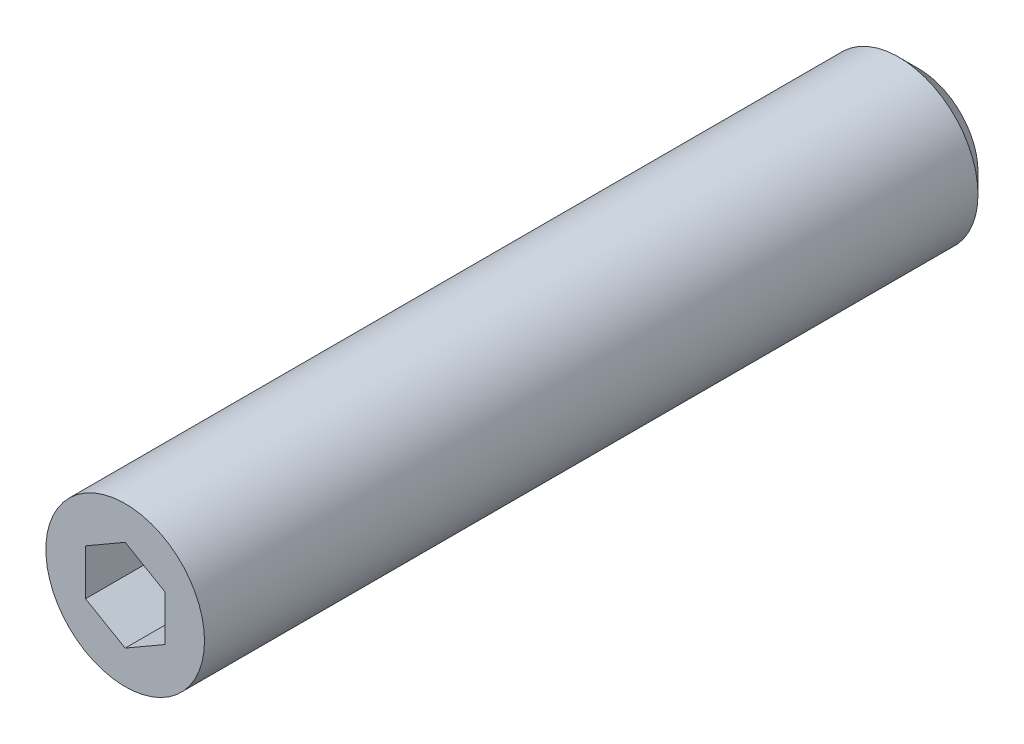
ISO-10303-21;
HEADER;
FILE_DESCRIPTION(('STEP AP214'),'2;1');
FILE_NAME('part.step','',(''),(''),'','','');
FILE_SCHEMA(('AUTOMOTIVE_DESIGN { 1 0 10303 214 1 1 1 1 }'));
ENDSEC;
DATA;
#1=APPLICATION_CONTEXT('core data for automotive mechanical design processes');
#2=APPLICATION_PROTOCOL_DEFINITION('international standard','automotive_design',2000,#1);
#3=PRODUCT_CONTEXT('',#1,'mechanical');
#4=PRODUCT('Part','Part','',(#3));
#5=PRODUCT_RELATED_PRODUCT_CATEGORY('part','',(#4));
#6=PRODUCT_DEFINITION_FORMATION('','',#4);
#7=PRODUCT_DEFINITION_CONTEXT('part definition',#1,'design');
#8=PRODUCT_DEFINITION('design','',#6,#7);
#9=PRODUCT_DEFINITION_SHAPE('','',#8);
#10=(LENGTH_UNIT() NAMED_UNIT(*) SI_UNIT(.MILLI.,.METRE.));
#11=(NAMED_UNIT(*) PLANE_ANGLE_UNIT() SI_UNIT($,.RADIAN.));
#12=(NAMED_UNIT(*) SI_UNIT($,.STERADIAN.) SOLID_ANGLE_UNIT());
#13=UNCERTAINTY_MEASURE_WITH_UNIT(LENGTH_MEASURE(1.E-05),#10,'distance_accuracy_value','');
#14=(GEOMETRIC_REPRESENTATION_CONTEXT(3) GLOBAL_UNCERTAINTY_ASSIGNED_CONTEXT((#13)) GLOBAL_UNIT_ASSIGNED_CONTEXT((#10,
#11,#12)) REPRESENTATION_CONTEXT('',''));
#15=CARTESIAN_POINT('',(0.,0.,0.));
#16=DIRECTION('',(0.,0.,1.));
#17=DIRECTION('',(1.,0.,0.));
#18=AXIS2_PLACEMENT_3D('',#15,#16,#17);
#19=CARTESIAN_POINT('',(0.,4.61880215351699,74.));
#20=DIRECTION('',(-0.5,-0.866025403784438,0.));
#21=DIRECTION('',(0.866025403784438,-0.5,0.));
#22=AXIS2_PLACEMENT_3D('',#19,#20,#21);
#23=PLANE('',#22);
#24=DIRECTION('',(0.,0.,1.));
#25=VECTOR('',#24,1.);
#26=CARTESIAN_POINT('',(4.,2.30940107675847,74.));
#27=LINE('',#26,#25);
#28=CARTESIAN_POINT('',(4.,2.30940107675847,74.));
#29=VERTEX_POINT('',#28);
#30=CARTESIAN_POINT('',(4.,2.30940107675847,80.));
#31=VERTEX_POINT('',#30);
#32=EDGE_CURVE('E63',#29,#31,#27,.T.);
#33=ORIENTED_EDGE('',*,*,#32,.T.);
#34=DIRECTION('',(0.866025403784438,-0.5,0.));
#35=VECTOR('',#34,1.);
#36=CARTESIAN_POINT('',(0.,4.61880215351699,80.));
#37=LINE('',#36,#35);
#38=CARTESIAN_POINT('',(0.,4.61880215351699,80.));
#39=VERTEX_POINT('',#38);
#40=EDGE_CURVE('E29',#39,#31,#37,.T.);
#41=ORIENTED_EDGE('',*,*,#40,.F.);
#42=DIRECTION('',(0.,0.,1.));
#43=VECTOR('',#42,1.);
#44=CARTESIAN_POINT('',(0.,4.61880215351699,74.));
#45=LINE('',#44,#43);
#46=CARTESIAN_POINT('',(0.,4.61880215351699,74.));
#47=VERTEX_POINT('',#46);
#48=EDGE_CURVE('E33',#47,#39,#45,.T.);
#49=ORIENTED_EDGE('',*,*,#48,.F.);
#50=DIRECTION('',(0.866025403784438,-0.5,0.));
#51=VECTOR('',#50,1.);
#52=CARTESIAN_POINT('',(0.,4.61880215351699,74.));
#53=LINE('',#52,#51);
#54=EDGE_CURVE('E65',#47,#29,#53,.T.);
#55=ORIENTED_EDGE('',*,*,#54,.T.);
#56=EDGE_LOOP('',(#33,#41,#49,#55));
#57=FACE_BOUND('',#56,.T.);
#58=ADVANCED_FACE('F14',(#57),#23,.T.);
#59=CARTESIAN_POINT('',(4.,2.30940107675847,74.));
#60=DIRECTION('',(-1.,0.,0.));
#61=DIRECTION('',(0.,-1.,0.));
#62=AXIS2_PLACEMENT_3D('',#59,#60,#61);
#63=PLANE('',#62);
#64=DIRECTION('',(0.,0.,1.));
#65=VECTOR('',#64,1.);
#66=CARTESIAN_POINT('',(4.,-2.3094010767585,74.));
#67=LINE('',#66,#65);
#68=CARTESIAN_POINT('',(4.,-2.3094010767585,74.));
#69=VERTEX_POINT('',#68);
#70=CARTESIAN_POINT('',(4.,-2.3094010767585,80.));
#71=VERTEX_POINT('',#70);
#72=EDGE_CURVE('E70',#69,#71,#67,.T.);
#73=ORIENTED_EDGE('',*,*,#72,.T.);
#74=DIRECTION('',(0.,-1.,0.));
#75=VECTOR('',#74,1.);
#76=CARTESIAN_POINT('',(4.,2.30940107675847,80.));
#77=LINE('',#76,#75);
#78=EDGE_CURVE('E73',#31,#71,#77,.T.);
#79=ORIENTED_EDGE('',*,*,#78,.F.);
#80=ORIENTED_EDGE('',*,*,#32,.F.);
#81=DIRECTION('',(0.,-1.,0.));
#82=VECTOR('',#81,1.);
#83=CARTESIAN_POINT('',(4.,2.30940107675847,74.));
#84=LINE('',#83,#82);
#85=EDGE_CURVE('E100',#29,#69,#84,.T.);
#86=ORIENTED_EDGE('',*,*,#85,.T.);
#87=EDGE_LOOP('',(#73,#79,#80,#86));
#88=FACE_BOUND('',#87,.T.);
#89=ADVANCED_FACE('F74',(#88),#63,.T.);
#90=CARTESIAN_POINT('',(0.,-4.61880215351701,74.));
#91=DIRECTION('',(0.5,-0.866025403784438,0.));
#92=DIRECTION('',(0.866025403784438,0.5,0.));
#93=AXIS2_PLACEMENT_3D('',#90,#91,#92);
#94=PLANE('',#93);
#95=DIRECTION('',(0.,0.,1.));
#96=VECTOR('',#95,1.);
#97=CARTESIAN_POINT('',(0.,-4.61880215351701,74.));
#98=LINE('',#97,#96);
#99=CARTESIAN_POINT('',(0.,-4.61880215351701,74.));
#100=VERTEX_POINT('',#99);
#101=CARTESIAN_POINT('',(0.,-4.61880215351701,80.));
#102=VERTEX_POINT('',#101);
#103=EDGE_CURVE('E108',#100,#102,#98,.T.);
#104=ORIENTED_EDGE('',*,*,#103,.T.);
#105=DIRECTION('',(0.866025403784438,0.5,0.));
#106=VECTOR('',#105,1.);
#107=CARTESIAN_POINT('',(0.,-4.61880215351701,80.));
#108=LINE('',#107,#106);
#109=EDGE_CURVE('E78',#102,#71,#108,.T.);
#110=ORIENTED_EDGE('',*,*,#109,.T.);
#111=ORIENTED_EDGE('',*,*,#72,.F.);
#112=DIRECTION('',(0.866025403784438,0.5,0.));
#113=VECTOR('',#112,1.);
#114=CARTESIAN_POINT('',(0.,-4.61880215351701,74.));
#115=LINE('',#114,#113);
#116=EDGE_CURVE('E97',#100,#69,#115,.T.);
#117=ORIENTED_EDGE('',*,*,#116,.F.);
#118=EDGE_LOOP('',(#104,#110,#111,#117));
#119=FACE_BOUND('',#118,.T.);
#120=ADVANCED_FACE('F135',(#119),#94,.F.);
#121=CARTESIAN_POINT('',(0.,-4.61880215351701,74.));
#122=DIRECTION('',(0.5,0.866025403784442,0.));
#123=DIRECTION('',(-0.866025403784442,0.5,0.));
#124=AXIS2_PLACEMENT_3D('',#121,#122,#123);
#125=PLANE('',#124);
#126=DIRECTION('',(0.,0.,1.));
#127=VECTOR('',#126,1.);
#128=CARTESIAN_POINT('',(-4.,-2.30940107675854,74.));
#129=LINE('',#128,#127);
#130=CARTESIAN_POINT('',(-4.,-2.30940107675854,74.));
#131=VERTEX_POINT('',#130);
#132=CARTESIAN_POINT('',(-4.,-2.30940107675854,80.));
#133=VERTEX_POINT('',#132);
#134=EDGE_CURVE('E106',#131,#133,#129,.T.);
#135=ORIENTED_EDGE('',*,*,#134,.T.);
#136=DIRECTION('',(-0.866025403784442,0.5,0.));
#137=VECTOR('',#136,1.);
#138=CARTESIAN_POINT('',(0.,-4.61880215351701,80.));
#139=LINE('',#138,#137);
#140=EDGE_CURVE('E173',#102,#133,#139,.T.);
#141=ORIENTED_EDGE('',*,*,#140,.F.);
#142=ORIENTED_EDGE('',*,*,#103,.F.);
#143=DIRECTION('',(-0.866025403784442,0.5,0.));
#144=VECTOR('',#143,1.);
#145=CARTESIAN_POINT('',(0.,-4.61880215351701,74.));
#146=LINE('',#145,#144);
#147=EDGE_CURVE('E94',#100,#131,#146,.T.);
#148=ORIENTED_EDGE('',*,*,#147,.T.);
#149=EDGE_LOOP('',(#135,#141,#142,#148));
#150=FACE_BOUND('',#149,.T.);
#151=ADVANCED_FACE('F147',(#150),#125,.T.);
#152=CARTESIAN_POINT('',(-4.,2.30940107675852,74.));
#153=DIRECTION('',(-1.,0.,0.));
#154=DIRECTION('',(0.,-1.,0.));
#155=AXIS2_PLACEMENT_3D('',#152,#153,#154);
#156=PLANE('',#155);
#157=DIRECTION('',(0.,0.,1.));
#158=VECTOR('',#157,1.);
#159=CARTESIAN_POINT('',(-4.,2.30940107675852,74.));
#160=LINE('',#159,#158);
#161=CARTESIAN_POINT('',(-4.,2.30940107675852,74.));
#162=VERTEX_POINT('',#161);
#163=CARTESIAN_POINT('',(-4.,2.30940107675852,80.));
#164=VERTEX_POINT('',#163);
#165=EDGE_CURVE('E104',#162,#164,#160,.T.);
#166=ORIENTED_EDGE('',*,*,#165,.T.);
#167=DIRECTION('',(0.,-1.,0.));
#168=VECTOR('',#167,1.);
#169=CARTESIAN_POINT('',(-4.,2.30940107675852,80.));
#170=LINE('',#169,#168);
#171=EDGE_CURVE('E174',#164,#133,#170,.T.);
#172=ORIENTED_EDGE('',*,*,#171,.T.);
#173=ORIENTED_EDGE('',*,*,#134,.F.);
#174=DIRECTION('',(0.,-1.,0.));
#175=VECTOR('',#174,1.);
#176=CARTESIAN_POINT('',(-4.,2.30940107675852,74.));
#177=LINE('',#176,#175);
#178=EDGE_CURVE('E91',#162,#131,#177,.T.);
#179=ORIENTED_EDGE('',*,*,#178,.F.);
#180=EDGE_LOOP('',(#166,#172,#173,#179));
#181=FACE_BOUND('',#180,.T.);
#182=ADVANCED_FACE('F143',(#181),#156,.F.);
#183=CARTESIAN_POINT('',(0.,4.61880215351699,74.));
#184=DIRECTION('',(-0.499999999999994,0.866025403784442,0.));
#185=DIRECTION('',(-0.866025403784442,-0.499999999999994,0.));
#186=AXIS2_PLACEMENT_3D('',#183,#184,#185);
#187=PLANE('',#186);
#188=DIRECTION('',(-0.866025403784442,-0.499999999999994,0.));
#189=VECTOR('',#188,1.);
#190=CARTESIAN_POINT('',(0.,4.61880215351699,74.));
#191=LINE('',#190,#189);
#192=EDGE_CURVE('E88',#47,#162,#191,.T.);
#193=ORIENTED_EDGE('',*,*,#192,.F.);
#194=ORIENTED_EDGE('',*,*,#48,.T.);
#195=DIRECTION('',(-0.866025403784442,-0.499999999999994,0.));
#196=VECTOR('',#195,1.);
#197=CARTESIAN_POINT('',(0.,4.61880215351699,80.));
#198=LINE('',#197,#196);
#199=EDGE_CURVE('E84',#39,#164,#198,.T.);
#200=ORIENTED_EDGE('',*,*,#199,.T.);
#201=ORIENTED_EDGE('',*,*,#165,.F.);
#202=EDGE_LOOP('',(#193,#194,#200,#201));
#203=FACE_BOUND('',#202,.T.);
#204=ADVANCED_FACE('F140',(#203),#187,.F.);
#205=CARTESIAN_POINT('',(8.,0.,74.));
#206=DIRECTION('',(0.,0.,1.));
#207=DIRECTION('',(1.,0.,0.));
#208=AXIS2_PLACEMENT_3D('',#205,#206,#207);
#209=PLANE('',#208);
#210=ORIENTED_EDGE('',*,*,#54,.F.);
#211=ORIENTED_EDGE('',*,*,#192,.T.);
#212=ORIENTED_EDGE('',*,*,#178,.T.);
#213=ORIENTED_EDGE('',*,*,#147,.F.);
#214=ORIENTED_EDGE('',*,*,#116,.T.);
#215=ORIENTED_EDGE('',*,*,#85,.F.);
#216=EDGE_LOOP('',(#210,#211,#212,#213,#214,#215));
#217=FACE_BOUND('',#216,.T.);
#218=ADVANCED_FACE('F139',(#217),#209,.T.);
#219=CARTESIAN_POINT('',(8.,0.,80.));
#220=DIRECTION('',(0.,0.,-1.));
#221=DIRECTION('',(-1.,0.,0.));
#222=AXIS2_PLACEMENT_3D('',#219,#220,#221);
#223=PLANE('',#222);
#224=CARTESIAN_POINT('',(0.,0.,80.));
#225=DIRECTION('',(0.,0.,1.));
#226=DIRECTION('',(1.,0.,0.));
#227=AXIS2_PLACEMENT_3D('',#224,#225,#226);
#228=CIRCLE('',#227,8.);
#229=CARTESIAN_POINT('',(8.,0.,80.));
#230=VERTEX_POINT('',#229);
#231=EDGE_CURVE('E69',#230,#230,#228,.T.);
#232=ORIENTED_EDGE('',*,*,#231,.T.);
#233=EDGE_LOOP('',(#232));
#234=FACE_BOUND('',#233,.T.);
#235=ORIENTED_EDGE('',*,*,#40,.T.);
#236=ORIENTED_EDGE('',*,*,#78,.T.);
#237=ORIENTED_EDGE('',*,*,#109,.F.);
#238=ORIENTED_EDGE('',*,*,#140,.T.);
#239=ORIENTED_EDGE('',*,*,#171,.F.);
#240=ORIENTED_EDGE('',*,*,#199,.F.);
#241=EDGE_LOOP('',(#235,#236,#237,#238,#239,#240));
#242=FACE_BOUND('',#241,.T.);
#243=ADVANCED_FACE('F81',(#234,#242),#223,.F.);
#244=CARTESIAN_POINT('',(0.,0.,0.));
#245=DIRECTION('',(0.,0.,1.));
#246=DIRECTION('',(1.,0.,0.));
#247=AXIS2_PLACEMENT_3D('',#244,#245,#246);
#248=PLANE('',#247);
#249=CARTESIAN_POINT('',(0.,0.,0.));
#250=DIRECTION('',(0.,0.,1.));
#251=DIRECTION('',(1.,0.,0.));
#252=AXIS2_PLACEMENT_3D('',#249,#250,#251);
#253=CIRCLE('',#252,6.);
#254=CARTESIAN_POINT('',(6.,0.,0.));
#255=VERTEX_POINT('',#254);
#256=EDGE_CURVE('E9',#255,#255,#253,.T.);
#257=ORIENTED_EDGE('',*,*,#256,.F.);
#258=EDGE_LOOP('',(#257));
#259=FACE_BOUND('',#258,.T.);
#260=ADVANCED_FACE('F16',(#259),#248,.F.);
#261=CARTESIAN_POINT('',(0.,0.,2.));
#262=DIRECTION('',(0.,0.,1.));
#263=DIRECTION('',(1.,0.,0.));
#264=AXIS2_PLACEMENT_3D('',#261,#262,#263);
#265=CONICAL_SURFACE('',#264,8.,0.78539816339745);
#266=ORIENTED_EDGE('',*,*,#256,.T.);
#267=EDGE_LOOP('',(#266));
#268=FACE_BOUND('',#267,.T.);
#269=CARTESIAN_POINT('',(0.,0.,2.));
#270=DIRECTION('',(0.,0.,1.));
#271=DIRECTION('',(1.,0.,0.));
#272=AXIS2_PLACEMENT_3D('',#269,#270,#271);
#273=CIRCLE('',#272,8.);
#274=CARTESIAN_POINT('',(8.,0.,2.));
#275=VERTEX_POINT('',#274);
#276=EDGE_CURVE('E22',#275,#275,#273,.T.);
#277=ORIENTED_EDGE('',*,*,#276,.F.);
#278=EDGE_LOOP('',(#277));
#279=FACE_BOUND('',#278,.T.);
#280=ADVANCED_FACE('F117',(#268,#279),#265,.T.);
#281=CARTESIAN_POINT('',(0.,0.,110.));
#282=DIRECTION('',(0.,0.,1.));
#283=DIRECTION('',(1.,0.,0.));
#284=AXIS2_PLACEMENT_3D('',#281,#282,#283);
#285=CYLINDRICAL_SURFACE('',#284,8.);
#286=ORIENTED_EDGE('',*,*,#231,.F.);
#287=EDGE_LOOP('',(#286));
#288=FACE_BOUND('',#287,.T.);
#289=ORIENTED_EDGE('',*,*,#276,.T.);
#290=EDGE_LOOP('',(#289));
#291=FACE_BOUND('',#290,.T.);
#292=ADVANCED_FACE('F115',(#288,#291),#285,.T.);
#293=CLOSED_SHELL('',(#58,#89,#120,#151,#182,#204,#218,#243,#260,#280,#292));
#294=MANIFOLD_SOLID_BREP('B1',#293);
#295=ADVANCED_BREP_SHAPE_REPRESENTATION('',(#18,#294),#14);
#296=SHAPE_DEFINITION_REPRESENTATION(#9,#295);
ENDSEC;
END-ISO-10303-21;
